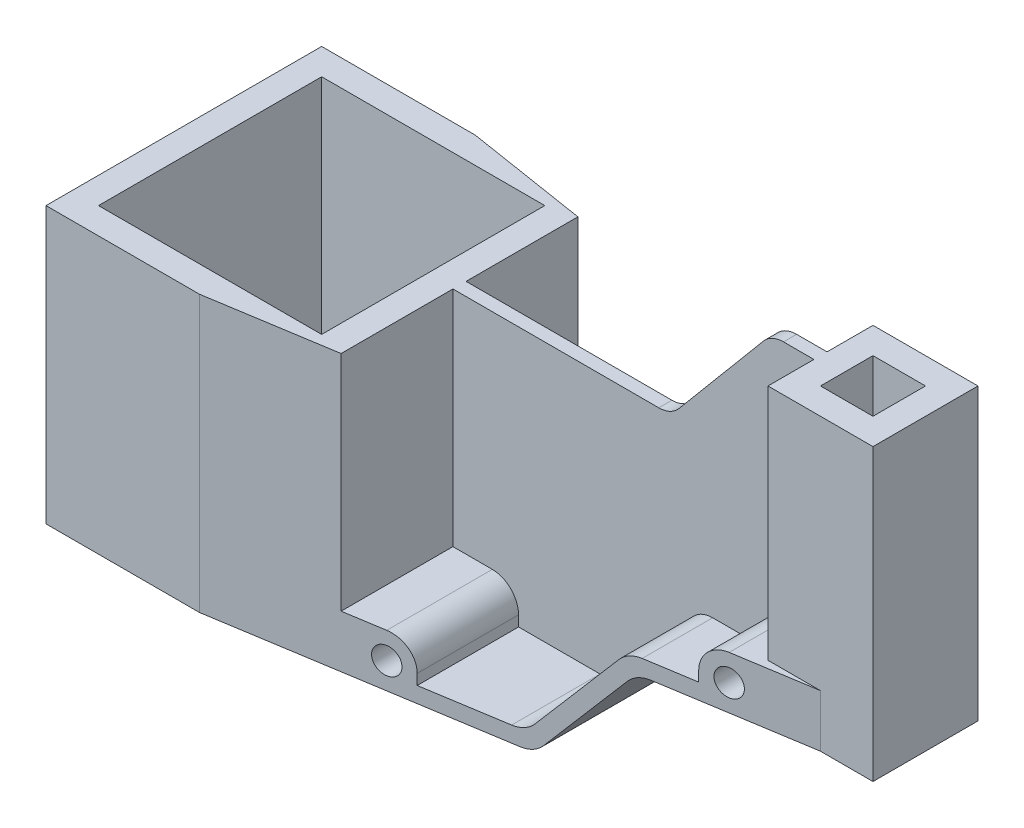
from build123d import *

# Parameters (mm, degrees)
ESQUISSE1_R                  = 5
BOSS_EXTRU_1_DEPTH           = 52.5
ENL_V_MAT_EXTRU_1_DEPTH      = 202.552721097
ESQUISSE8_W                  = 40
ESQUISSE8_H                  = 40
BOSS_EXTRU_2_DEPTH           = 90.5
ESQUISSE9_W                  = 20
ESQUISSE9_H                  = 40
BOSS_EXTRU_3_DEPTH           = 20
BOSS_EXTRU_4_DEPTH           = 2.5
ENL_V_MAT_EXTRU_2_DEPTH      = 202.552721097
ENL_V_MAT_EXTRU_2_DEPTH_BACK = 202.552721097
ESQUISSE12_W                 = 85
ESQUISSE12_H                 = 85
ESQUISSE12_W_2               = 20
ESQUISSE12_H_2               = 20


with BuildPart() as part:
    # Esquisse1 → Boss.-Extru.1 (new, symmetric)
    with BuildSketch(Plane.XY):
        with BuildLine():
            Line((98.663955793, 60), (68.663955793, 60))
            ThreePointArc((68.663955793, 60), (61.592887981, 57.071067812), (58.663955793, 50))
            Line((58.663955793, 50), (58.663955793, 46))
            Line((58.663955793, 46), (40.092292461, 46))
            ThreePointArc((40.092292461, 46), (35.866109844, 45.06307787), (32.43184803, 42.427876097))
            Line((32.43184803, 42.427876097), (4.862598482, 9.572123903))
            ThreePointArc((4.862598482, 9.572123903), (1.428336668, 6.93692213), (-2.797845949, 6))
            Line((-2.797845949, 6), (-33.836044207, 6))
            Line((-33.836044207, 6), (-33.836044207, 10))
            ThreePointArc((-33.836044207, 10), (-36.764976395, 17.071067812), (-43.836044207, 20))
            Line((-43.836044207, 20), (-58.836044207, 20))
            Line((-58.836044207, 20), (-58.836044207, 105))
            Line((-58.836044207, 105), (-163.836044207, 105))
            Line((-163.836044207, 105), (-163.836044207, 0))
            Line((-163.836044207, 0), (0, 0))
            ThreePointArc((0, 0), (4.226182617, 0.93692213), (7.660444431, 3.572123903))
            Line((7.660444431, 3.572123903), (35.229693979, 36.427876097))
            ThreePointArc((35.229693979, 36.427876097), (38.663955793, 39.06307787), (42.89013841, 40))
            Line((42.89013841, 40), (98.663955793, 40))
            Line((98.663955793, 40), (98.663955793, 60))
        make_face()
        with Locations((68.663955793, 50)):
            Circle(ESQUISSE1_R, mode=Mode.SUBTRACT)
        with Locations((-43.836044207, 10)):
            Circle(ESQUISSE1_R, mode=Mode.SUBTRACT)
    extrude(amount=BOSS_EXTRU_1_DEPTH, both=True)

    # Esquisse5 → Enl_v. mat.-Extru.1 (cut, through all)
    with BuildSketch(Plane(origin=(0, 0, 0), x_dir=(1, 0, 0), z_dir=(0, 1, 0))):
        Polygon((-105.336044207, -52.5), (98.663955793, -20), (98.663955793, -52.5), align=None)
        Polygon((98.663955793, 20), (98.663955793, 52.5), (-105.336044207, 52.5), align=None)
    extrude(amount=ENL_V_MAT_EXTRU_1_DEPTH, mode=Mode.SUBTRACT)

    # Esquisse8 → Boss.-Extru.2 (add)
    with BuildSketch(Plane(origin=(0, 60, 0), x_dir=(1, 0, 0), z_dir=(0, 1, 0))):
        with Locations((98.663955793, 0)):
            Rectangle(ESQUISSE8_W, ESQUISSE8_H)
    extrude(amount=BOSS_EXTRU_2_DEPTH)

    # Esquisse9 → Boss.-Extru.3 (add)
    with BuildSketch(Plane.XZ.offset(-40)):
        with Locations((108.663955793, 0)):
            Rectangle(ESQUISSE9_W, ESQUISSE9_H)
    extrude(amount=-BOSS_EXTRU_3_DEPTH)

    # Esquisse11 → Boss.-Extru.4 (add, symmetric)
    with BuildSketch(Plane.XY):
        with BuildLine():
            Line((27.232023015, 108.572123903), (59.416320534, 146.927876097))
            ThreePointArc((59.416320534, 146.927876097), (62.850582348, 149.56307787), (67.076764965, 150.5))
            Line((67.076764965, 150.5), (78.663955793, 150.5))
            Line((78.663955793, 150.5), (78.663955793, 60))
            Line((78.663955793, 60), (68.663955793, 60))
            ThreePointArc((68.663955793, 60), (61.592887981, 57.071067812), (58.663955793, 50))
            Line((58.663955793, 50), (58.663955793, 46))
            Line((58.663955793, 46), (40.092292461, 46))
            ThreePointArc((40.092292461, 46), (35.866109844, 45.06307787), (32.43184803, 42.427876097))
            Line((32.43184803, 42.427876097), (4.862598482, 9.572123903))
            ThreePointArc((4.862598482, 9.572123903), (1.428336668, 6.93692213), (-2.797845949, 6))
            Line((-2.797845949, 6), (-33.836044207, 6))
            Line((-33.836044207, 6), (-33.836044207, 10))
            ThreePointArc((-33.836044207, 10), (-36.764976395, 17.071067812), (-43.836044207, 20))
            Line((-43.836044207, 20), (-58.836044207, 20))
            Line((-58.836044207, 20), (-58.836044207, 105))
            Line((-58.836044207, 105), (19.571578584, 105))
            ThreePointArc((19.571578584, 105), (23.797761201, 105.93692213), (27.232023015, 108.572123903))
        make_face()
    extrude(amount=BOSS_EXTRU_4_DEPTH, both=True)

    # Esquisse12 → Enl_v. mat.-Extru.2 (cut, two sides: drawn at the far end of the back side and taken through both)
    with BuildSketch(Plane(origin=(0, 105, 0), x_dir=(1, 0, 0), z_dir=(0, 1, 0)).offset(-ENL_V_MAT_EXTRU_2_DEPTH_BACK)):
        with Locations((-111.336044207, 0)):
            Rectangle(ESQUISSE12_W, ESQUISSE12_H)
        with Locations((98.663955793, 0)):
            Rectangle(ESQUISSE12_W_2, ESQUISSE12_H_2)
    extrude(amount=ENL_V_MAT_EXTRU_2_DEPTH + ENL_V_MAT_EXTRU_2_DEPTH_BACK, mode=Mode.SUBTRACT)


solid = part.part
